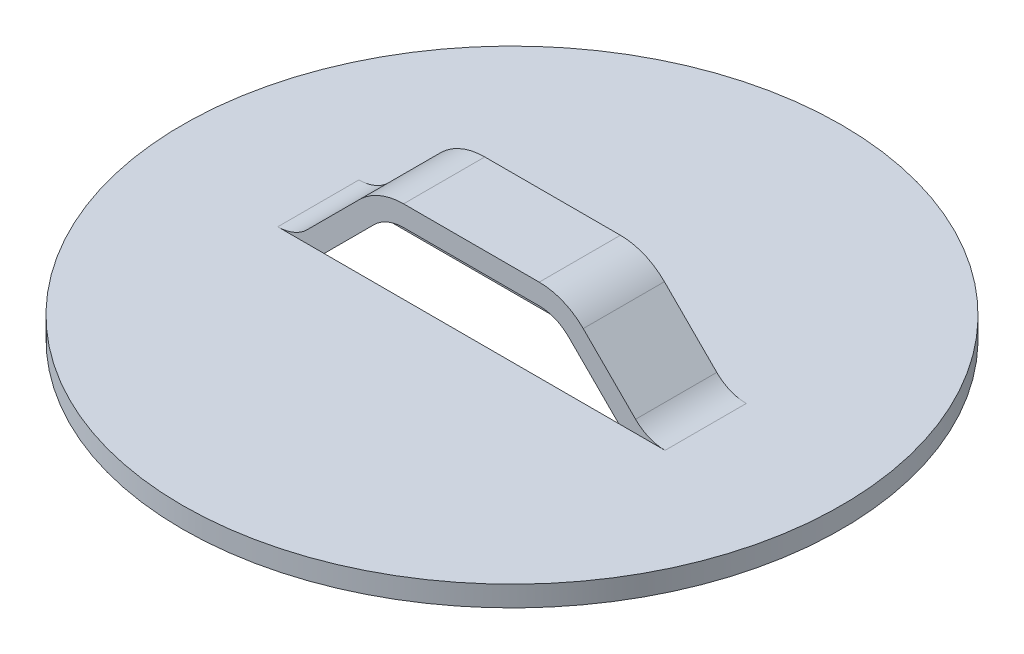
ISO-10303-21;
HEADER;
FILE_DESCRIPTION(('STEP AP214'),'2;1');
FILE_NAME('part.step','',(''),(''),'','','');
FILE_SCHEMA(('AUTOMOTIVE_DESIGN { 1 0 10303 214 1 1 1 1 }'));
ENDSEC;
DATA;
#1=APPLICATION_CONTEXT('core data for automotive mechanical design processes');
#2=APPLICATION_PROTOCOL_DEFINITION('international standard','automotive_design',2000,#1);
#3=PRODUCT_CONTEXT('',#1,'mechanical');
#4=PRODUCT('Part','Part','',(#3));
#5=PRODUCT_RELATED_PRODUCT_CATEGORY('part','',(#4));
#6=PRODUCT_DEFINITION_FORMATION('','',#4);
#7=PRODUCT_DEFINITION_CONTEXT('part definition',#1,'design');
#8=PRODUCT_DEFINITION('design','',#6,#7);
#9=PRODUCT_DEFINITION_SHAPE('','',#8);
#10=(LENGTH_UNIT() NAMED_UNIT(*) SI_UNIT(.MILLI.,.METRE.));
#11=(NAMED_UNIT(*) PLANE_ANGLE_UNIT() SI_UNIT($,.RADIAN.));
#12=(NAMED_UNIT(*) SI_UNIT($,.STERADIAN.) SOLID_ANGLE_UNIT());
#13=UNCERTAINTY_MEASURE_WITH_UNIT(LENGTH_MEASURE(1.E-05),#10,'distance_accuracy_value','');
#14=(GEOMETRIC_REPRESENTATION_CONTEXT(3) GLOBAL_UNCERTAINTY_ASSIGNED_CONTEXT((#13)) GLOBAL_UNIT_ASSIGNED_CONTEXT((#10,
#11,#12)) REPRESENTATION_CONTEXT('',''));
#15=CARTESIAN_POINT('',(0.,0.,0.));
#16=DIRECTION('',(0.,0.,1.));
#17=DIRECTION('',(1.,0.,0.));
#18=AXIS2_PLACEMENT_3D('',#15,#16,#17);
#19=CARTESIAN_POINT('',(-9.32746093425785,2.0066,0.));
#20=DIRECTION('',(0.,0.,-1.));
#21=DIRECTION('',(-1.,0.,0.));
#22=AXIS2_PLACEMENT_3D('',#19,#20,#21);
#23=PLANE('',#22);
#24=DIRECTION('',(-1.,0.,0.));
#25=VECTOR('',#24,1.);
#26=CARTESIAN_POINT('',(-9.32746093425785,0.,0.));
#27=LINE('',#26,#25);
#28=CARTESIAN_POINT('',(9.32746093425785,0.,0.));
#29=VERTEX_POINT('',#28);
#30=CARTESIAN_POINT('',(7.09538004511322,0.,0.));
#31=VERTEX_POINT('',#30);
#32=EDGE_CURVE('E53',#29,#31,#27,.T.);
#33=ORIENTED_EDGE('',*,*,#32,.F.);
#34=CARTESIAN_POINT('',(9.32746093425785,2.0066,0.));
#35=DIRECTION('',(0.,0.,1.));
#36=DIRECTION('',(1.,0.,0.));
#37=AXIS2_PLACEMENT_3D('',#34,#35,#36);
#38=CIRCLE('',#37,2.0066);
#39=CARTESIAN_POINT('',(7.90858046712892,0.587719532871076,0.));
#40=VERTEX_POINT('',#39);
#41=EDGE_CURVE('E165',#29,#40,#38,.F.);
#42=ORIENTED_EDGE('',*,*,#41,.T.);
#43=DIRECTION('',(-0.707106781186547,0.707106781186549,0.));
#44=VECTOR('',#43,1.);
#45=CARTESIAN_POINT('',(5.3863595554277,3.10994044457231,0.));
#46=LINE('',#45,#44);
#47=CARTESIAN_POINT('',(5.3863595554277,3.10994044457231,0.));
#48=VERTEX_POINT('',#47);
#49=EDGE_CURVE('E196',#48,#40,#46,.F.);
#50=ORIENTED_EDGE('',*,*,#49,.F.);
#51=CARTESIAN_POINT('',(3.26701911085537,0.990599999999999,0.));
#52=DIRECTION('',(0.,0.,1.));
#53=DIRECTION('',(1.,0.,0.));
#54=AXIS2_PLACEMENT_3D('',#51,#52,#53);
#55=CIRCLE('',#54,2.9972);
#56=CARTESIAN_POINT('',(3.26701911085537,3.9878,0.));
#57=VERTEX_POINT('',#56);
#58=EDGE_CURVE('E200',#57,#48,#55,.F.);
#59=ORIENTED_EDGE('',*,*,#58,.F.);
#60=DIRECTION('',(1.,0.,0.));
#61=VECTOR('',#60,1.);
#62=CARTESIAN_POINT('',(-3.26701911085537,3.9878,0.));
#63=LINE('',#62,#61);
#64=CARTESIAN_POINT('',(-3.26701911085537,3.9878,0.));
#65=VERTEX_POINT('',#64);
#66=EDGE_CURVE('E204',#65,#57,#63,.T.);
#67=ORIENTED_EDGE('',*,*,#66,.F.);
#68=CARTESIAN_POINT('',(-3.26701911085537,0.990599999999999,0.));
#69=DIRECTION('',(0.,0.,1.));
#70=DIRECTION('',(1.,0.,0.));
#71=AXIS2_PLACEMENT_3D('',#68,#69,#70);
#72=CIRCLE('',#71,2.9972);
#73=CARTESIAN_POINT('',(-5.3863595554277,3.10994044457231,0.));
#74=VERTEX_POINT('',#73);
#75=EDGE_CURVE('E208',#74,#65,#72,.F.);
#76=ORIENTED_EDGE('',*,*,#75,.F.);
#77=DIRECTION('',(-0.707106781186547,-0.707106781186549,0.));
#78=VECTOR('',#77,1.);
#79=CARTESIAN_POINT('',(-7.90858046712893,0.587719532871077,0.));
#80=LINE('',#79,#78);
#81=CARTESIAN_POINT('',(-7.90858046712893,0.587719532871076,0.));
#82=VERTEX_POINT('',#81);
#83=EDGE_CURVE('E212',#82,#74,#80,.F.);
#84=ORIENTED_EDGE('',*,*,#83,.F.);
#85=CARTESIAN_POINT('',(-9.32746093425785,2.0066,0.));
#86=DIRECTION('',(0.,0.,1.));
#87=DIRECTION('',(1.,0.,0.));
#88=AXIS2_PLACEMENT_3D('',#85,#86,#87);
#89=CIRCLE('',#88,2.0066);
#90=CARTESIAN_POINT('',(-9.32746093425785,0.,0.));
#91=VERTEX_POINT('',#90);
#92=EDGE_CURVE('E216',#82,#91,#89,.F.);
#93=ORIENTED_EDGE('',*,*,#92,.T.);
#94=CARTESIAN_POINT('',(-7.09538004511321,0.,0.));
#95=VERTEX_POINT('',#94);
#96=EDGE_CURVE('E173',#95,#91,#27,.T.);
#97=ORIENTED_EDGE('',*,*,#96,.F.);
#98=DIRECTION('',(0.707106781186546,0.707106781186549,0.));
#99=VECTOR('',#98,1.);
#100=CARTESIAN_POINT('',(-7.20812048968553,-0.112740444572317,0.));
#101=LINE('',#100,#99);
#102=CARTESIAN_POINT('',(-4.6858995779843,2.40948046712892,0.));
#103=VERTEX_POINT('',#102);
#104=EDGE_CURVE('E218',#103,#95,#101,.F.);
#105=ORIENTED_EDGE('',*,*,#104,.F.);
#106=CARTESIAN_POINT('',(-3.26701911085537,0.990599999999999,0.));
#107=DIRECTION('',(0.,0.,1.));
#108=DIRECTION('',(1.,0.,0.));
#109=AXIS2_PLACEMENT_3D('',#106,#107,#108);
#110=CIRCLE('',#109,2.0066);
#111=CARTESIAN_POINT('',(-3.26701911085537,2.9972,0.));
#112=VERTEX_POINT('',#111);
#113=EDGE_CURVE('E222',#103,#112,#110,.F.);
#114=ORIENTED_EDGE('',*,*,#113,.T.);
#115=DIRECTION('',(1.,0.,0.));
#116=VECTOR('',#115,1.);
#117=CARTESIAN_POINT('',(-3.26701911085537,2.9972,0.));
#118=LINE('',#117,#116);
#119=CARTESIAN_POINT('',(3.26701911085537,2.9972,0.));
#120=VERTEX_POINT('',#119);
#121=EDGE_CURVE('E223',#120,#112,#118,.F.);
#122=ORIENTED_EDGE('',*,*,#121,.F.);
#123=CARTESIAN_POINT('',(3.26701911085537,0.990599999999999,0.));
#124=DIRECTION('',(0.,0.,1.));
#125=DIRECTION('',(1.,0.,0.));
#126=AXIS2_PLACEMENT_3D('',#123,#124,#125);
#127=CIRCLE('',#126,2.0066);
#128=CARTESIAN_POINT('',(4.6858995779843,2.40948046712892,0.));
#129=VERTEX_POINT('',#128);
#130=EDGE_CURVE('E226',#120,#129,#127,.F.);
#131=ORIENTED_EDGE('',*,*,#130,.T.);
#132=DIRECTION('',(0.707106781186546,-0.707106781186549,0.));
#133=VECTOR('',#132,1.);
#134=CARTESIAN_POINT('',(4.6858995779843,2.40948046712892,0.));
#135=LINE('',#134,#133);
#136=EDGE_CURVE('E168',#31,#129,#135,.F.);
#137=ORIENTED_EDGE('',*,*,#136,.F.);
#138=EDGE_LOOP('',(#33,#42,#50,#59,#67,#76,#84,#93,#97,#105,#114,#122,#131,#137));
#139=FACE_BOUND('',#138,.T.);
#140=ADVANCED_FACE('F39',(#139),#23,.F.);
#141=CARTESIAN_POINT('',(-9.32746093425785,2.0066,-3.9116));
#142=DIRECTION('',(0.,0.,-1.));
#143=DIRECTION('',(-1.,0.,0.));
#144=AXIS2_PLACEMENT_3D('',#141,#142,#143);
#145=PLANE('',#144);
#146=CARTESIAN_POINT('',(9.32746093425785,2.0066,-3.9116));
#147=DIRECTION('',(0.,0.,1.));
#148=DIRECTION('',(1.,0.,0.));
#149=AXIS2_PLACEMENT_3D('',#146,#147,#148);
#150=CIRCLE('',#149,2.0066);
#151=CARTESIAN_POINT('',(7.90858046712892,0.587719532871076,-3.9116));
#152=VERTEX_POINT('',#151);
#153=CARTESIAN_POINT('',(9.32746093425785,0.,-3.9116));
#154=VERTEX_POINT('',#153);
#155=EDGE_CURVE('E250',#152,#154,#150,.T.);
#156=ORIENTED_EDGE('',*,*,#155,.T.);
#157=DIRECTION('',(-1.,0.,0.));
#158=VECTOR('',#157,1.);
#159=CARTESIAN_POINT('',(-9.32746093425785,0.,-3.9116));
#160=LINE('',#159,#158);
#161=CARTESIAN_POINT('',(7.09538004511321,0.,-3.9116));
#162=VERTEX_POINT('',#161);
#163=EDGE_CURVE('E11',#154,#162,#160,.T.);
#164=ORIENTED_EDGE('',*,*,#163,.T.);
#165=DIRECTION('',(-0.707106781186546,0.707106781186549,0.));
#166=VECTOR('',#165,1.);
#167=CARTESIAN_POINT('',(7.20812048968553,-0.112740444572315,-3.9116));
#168=LINE('',#167,#166);
#169=CARTESIAN_POINT('',(4.6858995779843,2.40948046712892,-3.9116));
#170=VERTEX_POINT('',#169);
#171=EDGE_CURVE('E249',#162,#170,#168,.T.);
#172=ORIENTED_EDGE('',*,*,#171,.T.);
#173=CARTESIAN_POINT('',(3.26701911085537,0.990599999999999,-3.9116));
#174=DIRECTION('',(0.,0.,1.));
#175=DIRECTION('',(1.,0.,0.));
#176=AXIS2_PLACEMENT_3D('',#173,#174,#175);
#177=CIRCLE('',#176,2.0066);
#178=CARTESIAN_POINT('',(3.26701911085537,2.9972,-3.9116));
#179=VERTEX_POINT('',#178);
#180=EDGE_CURVE('E242',#170,#179,#177,.T.);
#181=ORIENTED_EDGE('',*,*,#180,.T.);
#182=DIRECTION('',(-1.,0.,0.));
#183=VECTOR('',#182,1.);
#184=CARTESIAN_POINT('',(-9.32746093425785,2.9972,-3.9116));
#185=LINE('',#184,#183);
#186=CARTESIAN_POINT('',(-3.26701911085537,2.9972,-3.9116));
#187=VERTEX_POINT('',#186);
#188=EDGE_CURVE('E241',#179,#187,#185,.T.);
#189=ORIENTED_EDGE('',*,*,#188,.T.);
#190=CARTESIAN_POINT('',(-3.26701911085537,0.990599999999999,-3.9116));
#191=DIRECTION('',(0.,0.,1.));
#192=DIRECTION('',(1.,0.,0.));
#193=AXIS2_PLACEMENT_3D('',#190,#191,#192);
#194=CIRCLE('',#193,2.0066);
#195=CARTESIAN_POINT('',(-4.6858995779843,2.40948046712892,-3.9116));
#196=VERTEX_POINT('',#195);
#197=EDGE_CURVE('E238',#187,#196,#194,.T.);
#198=ORIENTED_EDGE('',*,*,#197,.T.);
#199=DIRECTION('',(-0.707106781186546,-0.707106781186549,0.));
#200=VECTOR('',#199,1.);
#201=CARTESIAN_POINT('',(-4.6858995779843,2.40948046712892,-3.9116));
#202=LINE('',#201,#200);
#203=CARTESIAN_POINT('',(-7.09538004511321,0.,-3.9116));
#204=VERTEX_POINT('',#203);
#205=EDGE_CURVE('E237',#196,#204,#202,.T.);
#206=ORIENTED_EDGE('',*,*,#205,.T.);
#207=DIRECTION('',(1.,0.,0.));
#208=VECTOR('',#207,1.);
#209=CARTESIAN_POINT('',(-9.32746093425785,0.,-3.9116));
#210=LINE('',#209,#208);
#211=CARTESIAN_POINT('',(-9.32746093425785,0.,-3.9116));
#212=VERTEX_POINT('',#211);
#213=EDGE_CURVE('E285',#212,#204,#210,.T.);
#214=ORIENTED_EDGE('',*,*,#213,.F.);
#215=CARTESIAN_POINT('',(-9.32746093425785,2.0066,-3.9116));
#216=DIRECTION('',(0.,0.,1.));
#217=DIRECTION('',(1.,0.,0.));
#218=AXIS2_PLACEMENT_3D('',#215,#216,#217);
#219=CIRCLE('',#218,2.0066);
#220=CARTESIAN_POINT('',(-7.90858046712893,0.587719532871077,-3.9116));
#221=VERTEX_POINT('',#220);
#222=EDGE_CURVE('E261',#212,#221,#219,.T.);
#223=ORIENTED_EDGE('',*,*,#222,.T.);
#224=DIRECTION('',(0.707106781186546,0.707106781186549,0.));
#225=VECTOR('',#224,1.);
#226=CARTESIAN_POINT('',(-7.90858046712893,0.587719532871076,-3.9116));
#227=LINE('',#226,#225);
#228=CARTESIAN_POINT('',(-5.3863595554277,3.10994044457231,-3.9116));
#229=VERTEX_POINT('',#228);
#230=EDGE_CURVE('E260',#221,#229,#227,.T.);
#231=ORIENTED_EDGE('',*,*,#230,.T.);
#232=CARTESIAN_POINT('',(-3.26701911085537,0.990599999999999,-3.9116));
#233=DIRECTION('',(0.,0.,1.));
#234=DIRECTION('',(1.,0.,0.));
#235=AXIS2_PLACEMENT_3D('',#232,#233,#234);
#236=CIRCLE('',#235,2.9972);
#237=CARTESIAN_POINT('',(-3.26701911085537,3.9878,-3.9116));
#238=VERTEX_POINT('',#237);
#239=EDGE_CURVE('E257',#229,#238,#236,.F.);
#240=ORIENTED_EDGE('',*,*,#239,.T.);
#241=DIRECTION('',(-1.,0.,0.));
#242=VECTOR('',#241,1.);
#243=CARTESIAN_POINT('',(-9.32746093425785,3.9878,-3.9116));
#244=LINE('',#243,#242);
#245=CARTESIAN_POINT('',(3.26701911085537,3.9878,-3.9116));
#246=VERTEX_POINT('',#245);
#247=EDGE_CURVE('E256',#238,#246,#244,.F.);
#248=ORIENTED_EDGE('',*,*,#247,.T.);
#249=CARTESIAN_POINT('',(3.26701911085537,0.990599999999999,-3.9116));
#250=DIRECTION('',(0.,0.,1.));
#251=DIRECTION('',(1.,0.,0.));
#252=AXIS2_PLACEMENT_3D('',#249,#250,#251);
#253=CIRCLE('',#252,2.9972);
#254=CARTESIAN_POINT('',(5.3863595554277,3.10994044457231,-3.9116));
#255=VERTEX_POINT('',#254);
#256=EDGE_CURVE('E253',#246,#255,#253,.F.);
#257=ORIENTED_EDGE('',*,*,#256,.T.);
#258=DIRECTION('',(0.707106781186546,-0.707106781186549,0.));
#259=VECTOR('',#258,1.);
#260=CARTESIAN_POINT('',(5.3863595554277,3.10994044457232,-3.9116));
#261=LINE('',#260,#259);
#262=EDGE_CURVE('E252',#255,#152,#261,.T.);
#263=ORIENTED_EDGE('',*,*,#262,.T.);
#264=EDGE_LOOP('',(#156,#164,#172,#181,#189,#198,#206,#214,#223,#231,#240,#248,#257,#263));
#265=FACE_BOUND('',#264,.T.);
#266=ADVANCED_FACE('F355',(#265),#145,.T.);
#267=CARTESIAN_POINT('',(-9.32746093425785,2.0066,-3.9116));
#268=DIRECTION('',(0.,0.,1.));
#269=DIRECTION('',(1.,0.,0.));
#270=AXIS2_PLACEMENT_3D('',#267,#268,#269);
#271=CYLINDRICAL_SURFACE('',#270,2.0066);
#272=DIRECTION('',(0.,0.,1.));
#273=VECTOR('',#272,1.);
#274=CARTESIAN_POINT('',(-7.90858046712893,0.587719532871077,-3.9116));
#275=LINE('',#274,#273);
#276=EDGE_CURVE('E209',#221,#82,#275,.T.);
#277=ORIENTED_EDGE('',*,*,#276,.F.);
#278=ORIENTED_EDGE('',*,*,#222,.F.);
#279=DIRECTION('',(0.,0.,1.));
#280=VECTOR('',#279,1.);
#281=CARTESIAN_POINT('',(-9.32746093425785,0.,-3.9116));
#282=LINE('',#281,#280);
#283=EDGE_CURVE('E213',#91,#212,#282,.F.);
#284=ORIENTED_EDGE('',*,*,#283,.F.);
#285=ORIENTED_EDGE('',*,*,#92,.F.);
#286=EDGE_LOOP('',(#277,#278,#284,#285));
#287=FACE_BOUND('',#286,.T.);
#288=ADVANCED_FACE('F283',(#287),#271,.F.);
#289=CARTESIAN_POINT('',(-7.90858046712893,0.587719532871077,-3.9116));
#290=DIRECTION('',(-0.707106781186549,0.707106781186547,0.));
#291=DIRECTION('',(-0.707106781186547,-0.707106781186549,0.));
#292=AXIS2_PLACEMENT_3D('',#289,#290,#291);
#293=PLANE('',#292);
#294=ORIENTED_EDGE('',*,*,#230,.F.);
#295=ORIENTED_EDGE('',*,*,#276,.T.);
#296=ORIENTED_EDGE('',*,*,#83,.T.);
#297=DIRECTION('',(0.,0.,1.));
#298=VECTOR('',#297,1.);
#299=CARTESIAN_POINT('',(-5.3863595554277,3.10994044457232,-3.9116));
#300=LINE('',#299,#298);
#301=EDGE_CURVE('E205',#229,#74,#300,.T.);
#302=ORIENTED_EDGE('',*,*,#301,.F.);
#303=EDGE_LOOP('',(#294,#295,#296,#302));
#304=FACE_BOUND('',#303,.T.);
#305=ADVANCED_FACE('F364',(#304),#293,.T.);
#306=CARTESIAN_POINT('',(-3.26701911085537,0.990599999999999,-3.9116));
#307=DIRECTION('',(0.,0.,1.));
#308=DIRECTION('',(1.,0.,0.));
#309=AXIS2_PLACEMENT_3D('',#306,#307,#308);
#310=CYLINDRICAL_SURFACE('',#309,2.9972);
#311=ORIENTED_EDGE('',*,*,#239,.F.);
#312=ORIENTED_EDGE('',*,*,#301,.T.);
#313=ORIENTED_EDGE('',*,*,#75,.T.);
#314=DIRECTION('',(0.,0.,1.));
#315=VECTOR('',#314,1.);
#316=CARTESIAN_POINT('',(-3.26701911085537,3.9878,-3.9116));
#317=LINE('',#316,#315);
#318=EDGE_CURVE('E201',#238,#65,#317,.T.);
#319=ORIENTED_EDGE('',*,*,#318,.F.);
#320=EDGE_LOOP('',(#311,#312,#313,#319));
#321=FACE_BOUND('',#320,.T.);
#322=ADVANCED_FACE('F407',(#321),#310,.T.);
#323=CARTESIAN_POINT('',(-3.26701911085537,3.9878,-3.9116));
#324=DIRECTION('',(0.,1.,0.));
#325=DIRECTION('',(0.,0.,1.));
#326=AXIS2_PLACEMENT_3D('',#323,#324,#325);
#327=PLANE('',#326);
#328=ORIENTED_EDGE('',*,*,#247,.F.);
#329=ORIENTED_EDGE('',*,*,#318,.T.);
#330=ORIENTED_EDGE('',*,*,#66,.T.);
#331=DIRECTION('',(0.,0.,1.));
#332=VECTOR('',#331,1.);
#333=CARTESIAN_POINT('',(3.26701911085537,3.9878,-3.9116));
#334=LINE('',#333,#332);
#335=EDGE_CURVE('E197',#246,#57,#334,.T.);
#336=ORIENTED_EDGE('',*,*,#335,.F.);
#337=EDGE_LOOP('',(#328,#329,#330,#336));
#338=FACE_BOUND('',#337,.T.);
#339=ADVANCED_FACE('F403',(#338),#327,.T.);
#340=CARTESIAN_POINT('',(3.26701911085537,0.990599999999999,-3.9116));
#341=DIRECTION('',(0.,0.,1.));
#342=DIRECTION('',(1.,0.,0.));
#343=AXIS2_PLACEMENT_3D('',#340,#341,#342);
#344=CYLINDRICAL_SURFACE('',#343,2.9972);
#345=ORIENTED_EDGE('',*,*,#256,.F.);
#346=ORIENTED_EDGE('',*,*,#335,.T.);
#347=ORIENTED_EDGE('',*,*,#58,.T.);
#348=DIRECTION('',(0.,0.,1.));
#349=VECTOR('',#348,1.);
#350=CARTESIAN_POINT('',(5.3863595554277,3.10994044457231,-3.9116));
#351=LINE('',#350,#349);
#352=EDGE_CURVE('E193',#255,#48,#351,.T.);
#353=ORIENTED_EDGE('',*,*,#352,.F.);
#354=EDGE_LOOP('',(#345,#346,#347,#353));
#355=FACE_BOUND('',#354,.T.);
#356=ADVANCED_FACE('F399',(#355),#344,.T.);
#357=CARTESIAN_POINT('',(5.3863595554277,3.10994044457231,-3.9116));
#358=DIRECTION('',(0.707106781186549,0.707106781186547,0.));
#359=DIRECTION('',(-0.707106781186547,0.707106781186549,0.));
#360=AXIS2_PLACEMENT_3D('',#357,#358,#359);
#361=PLANE('',#360);
#362=ORIENTED_EDGE('',*,*,#262,.F.);
#363=ORIENTED_EDGE('',*,*,#352,.T.);
#364=ORIENTED_EDGE('',*,*,#49,.T.);
#365=DIRECTION('',(0.,0.,1.));
#366=VECTOR('',#365,1.);
#367=CARTESIAN_POINT('',(7.90858046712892,0.587719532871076,-3.9116));
#368=LINE('',#367,#366);
#369=EDGE_CURVE('E179',#40,#152,#368,.F.);
#370=ORIENTED_EDGE('',*,*,#369,.T.);
#371=EDGE_LOOP('',(#362,#363,#364,#370));
#372=FACE_BOUND('',#371,.T.);
#373=ADVANCED_FACE('F396',(#372),#361,.T.);
#374=CARTESIAN_POINT('',(9.32746093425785,2.0066,-3.9116));
#375=DIRECTION('',(0.,0.,1.));
#376=DIRECTION('',(1.,0.,0.));
#377=AXIS2_PLACEMENT_3D('',#374,#375,#376);
#378=CYLINDRICAL_SURFACE('',#377,2.0066);
#379=DIRECTION('',(0.,0.,1.));
#380=VECTOR('',#379,1.);
#381=CARTESIAN_POINT('',(9.32746093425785,0.,-3.9116));
#382=LINE('',#381,#380);
#383=EDGE_CURVE('E177',#154,#29,#382,.T.);
#384=ORIENTED_EDGE('',*,*,#383,.F.);
#385=ORIENTED_EDGE('',*,*,#155,.F.);
#386=ORIENTED_EDGE('',*,*,#369,.F.);
#387=ORIENTED_EDGE('',*,*,#41,.F.);
#388=EDGE_LOOP('',(#384,#385,#386,#387));
#389=FACE_BOUND('',#388,.T.);
#390=ADVANCED_FACE('F175',(#389),#378,.F.);
#391=CARTESIAN_POINT('',(9.32746093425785,0.,-3.9116));
#392=DIRECTION('',(0.,1.,0.));
#393=DIRECTION('',(0.,0.,1.));
#394=AXIS2_PLACEMENT_3D('',#391,#392,#393);
#395=PLANE('',#394);
#396=CARTESIAN_POINT('',(0.,0.,-1.9558));
#397=DIRECTION('',(0.,-1.,0.));
#398=DIRECTION('',(0.,0.,-1.));
#399=AXIS2_PLACEMENT_3D('',#396,#397,#398);
#400=CIRCLE('',#399,15.875);
#401=CARTESIAN_POINT('',(0.,0.,-17.8308));
#402=VERTEX_POINT('',#401);
#403=EDGE_CURVE('E294',#402,#402,#400,.T.);
#404=ORIENTED_EDGE('',*,*,#403,.F.);
#405=EDGE_LOOP('',(#404));
#406=FACE_BOUND('',#405,.T.);
#407=ORIENTED_EDGE('',*,*,#383,.T.);
#408=ORIENTED_EDGE('',*,*,#32,.T.);
#409=EDGE_CURVE('E171',#31,#95,#27,.T.);
#410=ORIENTED_EDGE('',*,*,#409,.T.);
#411=ORIENTED_EDGE('',*,*,#96,.T.);
#412=ORIENTED_EDGE('',*,*,#283,.T.);
#413=ORIENTED_EDGE('',*,*,#213,.T.);
#414=EDGE_CURVE('E170',#204,#162,#210,.T.);
#415=ORIENTED_EDGE('',*,*,#414,.T.);
#416=ORIENTED_EDGE('',*,*,#163,.F.);
#417=EDGE_LOOP('',(#407,#408,#410,#411,#412,#413,#415,#416));
#418=FACE_BOUND('',#417,.T.);
#419=ADVANCED_FACE('F182',(#406,#418),#395,.T.);
#420=CARTESIAN_POINT('',(9.32746093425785,2.0066,-3.9116));
#421=DIRECTION('',(0.,0.,1.));
#422=DIRECTION('',(1.,0.,0.));
#423=AXIS2_PLACEMENT_3D('',#420,#421,#422);
#424=CYLINDRICAL_SURFACE('',#423,2.9972);
#425=CARTESIAN_POINT('',(9.32746093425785,2.0066,-3.9116));
#426=DIRECTION('',(0.,0.,1.));
#427=DIRECTION('',(1.,0.,0.));
#428=AXIS2_PLACEMENT_3D('',#425,#426,#427);
#429=CIRCLE('',#428,2.9972);
#430=CARTESIAN_POINT('',(9.32746093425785,-0.9906,-3.9116));
#431=VERTEX_POINT('',#430);
#432=CARTESIAN_POINT('',(7.20812048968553,-0.112740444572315,-3.9116));
#433=VERTEX_POINT('',#432);
#434=EDGE_CURVE('E246',#431,#433,#429,.F.);
#435=ORIENTED_EDGE('',*,*,#434,.F.);
#436=DIRECTION('',(0.,0.,1.));
#437=VECTOR('',#436,1.);
#438=CARTESIAN_POINT('',(9.32746093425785,-0.990599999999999,-3.9116));
#439=LINE('',#438,#437);
#440=CARTESIAN_POINT('',(9.32746093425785,-0.9906,0.));
#441=VERTEX_POINT('',#440);
#442=EDGE_CURVE('E187',#431,#441,#439,.T.);
#443=ORIENTED_EDGE('',*,*,#442,.T.);
#444=CARTESIAN_POINT('',(9.32746093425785,2.0066,0.));
#445=DIRECTION('',(0.,0.,1.));
#446=DIRECTION('',(1.,0.,0.));
#447=AXIS2_PLACEMENT_3D('',#444,#445,#446);
#448=CIRCLE('',#447,2.9972);
#449=CARTESIAN_POINT('',(7.20812048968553,-0.112740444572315,0.));
#450=VERTEX_POINT('',#449);
#451=EDGE_CURVE('E184',#441,#450,#448,.F.);
#452=ORIENTED_EDGE('',*,*,#451,.T.);
#453=DIRECTION('',(0.,0.,1.));
#454=VECTOR('',#453,1.);
#455=CARTESIAN_POINT('',(7.20812048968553,-0.112740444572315,-3.9116));
#456=LINE('',#455,#454);
#457=EDGE_CURVE('E229',#433,#450,#456,.T.);
#458=ORIENTED_EDGE('',*,*,#457,.F.);
#459=EDGE_LOOP('',(#435,#443,#452,#458));
#460=FACE_BOUND('',#459,.T.);
#461=ADVANCED_FACE('F328',(#460),#424,.T.);
#462=CARTESIAN_POINT('',(4.6858995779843,2.40948046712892,-3.9116));
#463=DIRECTION('',(-0.707106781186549,-0.707106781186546,0.));
#464=DIRECTION('',(0.707106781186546,-0.707106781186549,0.));
#465=AXIS2_PLACEMENT_3D('',#462,#463,#464);
#466=PLANE('',#465);
#467=EDGE_CURVE('E245',#433,#162,#168,.T.);
#468=ORIENTED_EDGE('',*,*,#467,.F.);
#469=ORIENTED_EDGE('',*,*,#457,.T.);
#470=EDGE_CURVE('E227',#450,#31,#135,.F.);
#471=ORIENTED_EDGE('',*,*,#470,.T.);
#472=ORIENTED_EDGE('',*,*,#136,.T.);
#473=DIRECTION('',(0.,0.,1.));
#474=VECTOR('',#473,1.);
#475=CARTESIAN_POINT('',(4.6858995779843,2.40948046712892,-3.9116));
#476=LINE('',#475,#474);
#477=EDGE_CURVE('E272',#129,#170,#476,.F.);
#478=ORIENTED_EDGE('',*,*,#477,.T.);
#479=ORIENTED_EDGE('',*,*,#171,.F.);
#480=EDGE_LOOP('',(#468,#469,#471,#472,#478,#479));
#481=FACE_BOUND('',#480,.T.);
#482=ADVANCED_FACE('F325',(#481),#466,.T.);
#483=CARTESIAN_POINT('',(3.26701911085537,0.990599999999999,-3.9116));
#484=DIRECTION('',(0.,0.,1.));
#485=DIRECTION('',(1.,0.,0.));
#486=AXIS2_PLACEMENT_3D('',#483,#484,#485);
#487=CYLINDRICAL_SURFACE('',#486,2.0066);
#488=DIRECTION('',(0.,0.,1.));
#489=VECTOR('',#488,1.);
#490=CARTESIAN_POINT('',(3.26701911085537,2.9972,-3.9116));
#491=LINE('',#490,#489);
#492=EDGE_CURVE('E225',#179,#120,#491,.T.);
#493=ORIENTED_EDGE('',*,*,#492,.F.);
#494=ORIENTED_EDGE('',*,*,#180,.F.);
#495=ORIENTED_EDGE('',*,*,#477,.F.);
#496=ORIENTED_EDGE('',*,*,#130,.F.);
#497=EDGE_LOOP('',(#493,#494,#495,#496));
#498=FACE_BOUND('',#497,.T.);
#499=ADVANCED_FACE('F382',(#498),#487,.F.);
#500=CARTESIAN_POINT('',(-3.26701911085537,2.9972,-3.9116));
#501=DIRECTION('',(0.,-1.,0.));
#502=DIRECTION('',(1.,0.,0.));
#503=AXIS2_PLACEMENT_3D('',#500,#501,#502);
#504=PLANE('',#503);
#505=ORIENTED_EDGE('',*,*,#188,.F.);
#506=ORIENTED_EDGE('',*,*,#492,.T.);
#507=ORIENTED_EDGE('',*,*,#121,.T.);
#508=DIRECTION('',(0.,0.,1.));
#509=VECTOR('',#508,1.);
#510=CARTESIAN_POINT('',(-3.26701911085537,2.9972,-3.9116));
#511=LINE('',#510,#509);
#512=EDGE_CURVE('E271',#112,#187,#511,.F.);
#513=ORIENTED_EDGE('',*,*,#512,.T.);
#514=EDGE_LOOP('',(#505,#506,#507,#513));
#515=FACE_BOUND('',#514,.T.);
#516=ADVANCED_FACE('F378',(#515),#504,.T.);
#517=CARTESIAN_POINT('',(-3.26701911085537,0.990599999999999,-3.9116));
#518=DIRECTION('',(0.,0.,1.));
#519=DIRECTION('',(1.,0.,0.));
#520=AXIS2_PLACEMENT_3D('',#517,#518,#519);
#521=CYLINDRICAL_SURFACE('',#520,2.0066);
#522=DIRECTION('',(0.,0.,1.));
#523=VECTOR('',#522,1.);
#524=CARTESIAN_POINT('',(-4.6858995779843,2.40948046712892,-3.9116));
#525=LINE('',#524,#523);
#526=EDGE_CURVE('E221',#196,#103,#525,.T.);
#527=ORIENTED_EDGE('',*,*,#526,.F.);
#528=ORIENTED_EDGE('',*,*,#197,.F.);
#529=ORIENTED_EDGE('',*,*,#512,.F.);
#530=ORIENTED_EDGE('',*,*,#113,.F.);
#531=EDGE_LOOP('',(#527,#528,#529,#530));
#532=FACE_BOUND('',#531,.T.);
#533=ADVANCED_FACE('F375',(#532),#521,.F.);
#534=CARTESIAN_POINT('',(-7.20812048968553,-0.112740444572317,-3.9116));
#535=DIRECTION('',(0.707106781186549,-0.707106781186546,0.));
#536=DIRECTION('',(0.707106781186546,0.707106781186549,0.));
#537=AXIS2_PLACEMENT_3D('',#534,#535,#536);
#538=PLANE('',#537);
#539=ORIENTED_EDGE('',*,*,#205,.F.);
#540=ORIENTED_EDGE('',*,*,#526,.T.);
#541=ORIENTED_EDGE('',*,*,#104,.T.);
#542=DIRECTION('',(-0.707106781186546,-0.707106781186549,0.));
#543=VECTOR('',#542,1.);
#544=CARTESIAN_POINT('',(-7.20812048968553,-0.112740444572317,0.));
#545=LINE('',#544,#543);
#546=CARTESIAN_POINT('',(-7.20812048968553,-0.112740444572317,0.));
#547=VERTEX_POINT('',#546);
#548=EDGE_CURVE('E217',#95,#547,#545,.T.);
#549=ORIENTED_EDGE('',*,*,#548,.T.);
#550=DIRECTION('',(0.,0.,1.));
#551=VECTOR('',#550,1.);
#552=CARTESIAN_POINT('',(-7.20812048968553,-0.112740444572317,-3.9116));
#553=LINE('',#552,#551);
#554=CARTESIAN_POINT('',(-7.20812048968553,-0.112740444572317,-3.9116));
#555=VERTEX_POINT('',#554);
#556=EDGE_CURVE('E268',#555,#547,#553,.T.);
#557=ORIENTED_EDGE('',*,*,#556,.F.);
#558=EDGE_CURVE('E61',#204,#555,#202,.T.);
#559=ORIENTED_EDGE('',*,*,#558,.F.);
#560=EDGE_LOOP('',(#539,#540,#541,#549,#557,#559));
#561=FACE_BOUND('',#560,.T.);
#562=ADVANCED_FACE('F370',(#561),#538,.T.);
#563=CARTESIAN_POINT('',(-9.32746093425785,2.0066,-3.9116));
#564=DIRECTION('',(0.,0.,1.));
#565=DIRECTION('',(1.,0.,0.));
#566=AXIS2_PLACEMENT_3D('',#563,#564,#565);
#567=CYLINDRICAL_SURFACE('',#566,2.9972);
#568=CARTESIAN_POINT('',(-9.32746093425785,2.0066,-3.9116));
#569=DIRECTION('',(0.,0.,1.));
#570=DIRECTION('',(1.,0.,0.));
#571=AXIS2_PLACEMENT_3D('',#568,#569,#570);
#572=CIRCLE('',#571,2.9972);
#573=CARTESIAN_POINT('',(-9.32746093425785,-0.9906,-3.9116));
#574=VERTEX_POINT('',#573);
#575=EDGE_CURVE('E46',#555,#574,#572,.F.);
#576=ORIENTED_EDGE('',*,*,#575,.F.);
#577=ORIENTED_EDGE('',*,*,#556,.T.);
#578=CARTESIAN_POINT('',(-9.32746093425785,2.0066,0.));
#579=DIRECTION('',(0.,0.,1.));
#580=DIRECTION('',(1.,0.,0.));
#581=AXIS2_PLACEMENT_3D('',#578,#579,#580);
#582=CIRCLE('',#581,2.9972);
#583=CARTESIAN_POINT('',(-9.32746093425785,-0.9906,0.));
#584=VERTEX_POINT('',#583);
#585=EDGE_CURVE('E265',#547,#584,#582,.F.);
#586=ORIENTED_EDGE('',*,*,#585,.T.);
#587=DIRECTION('',(0.,0.,-1.));
#588=VECTOR('',#587,1.);
#589=CARTESIAN_POINT('',(-9.32746093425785,-0.9906,-3.9116));
#590=LINE('',#589,#588);
#591=EDGE_CURVE('E264',#574,#584,#590,.F.);
#592=ORIENTED_EDGE('',*,*,#591,.F.);
#593=EDGE_LOOP('',(#576,#577,#586,#592));
#594=FACE_BOUND('',#593,.T.);
#595=ADVANCED_FACE('F340',(#594),#567,.T.);
#596=CARTESIAN_POINT('',(-15.875,-0.9906,-3.9116));
#597=DIRECTION('',(0.,-1.,0.));
#598=DIRECTION('',(0.,0.,-1.));
#599=AXIS2_PLACEMENT_3D('',#596,#597,#598);
#600=PLANE('',#599);
#601=DIRECTION('',(-1.,0.,0.));
#602=VECTOR('',#601,1.);
#603=CARTESIAN_POINT('',(-9.32746093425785,-0.9906,0.));
#604=LINE('',#603,#602);
#605=EDGE_CURVE('E288',#441,#584,#604,.T.);
#606=ORIENTED_EDGE('',*,*,#605,.F.);
#607=ORIENTED_EDGE('',*,*,#442,.F.);
#608=DIRECTION('',(1.,0.,0.));
#609=VECTOR('',#608,1.);
#610=CARTESIAN_POINT('',(-9.32746093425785,-0.9906,-3.9116));
#611=LINE('',#610,#609);
#612=EDGE_CURVE('E286',#574,#431,#611,.T.);
#613=ORIENTED_EDGE('',*,*,#612,.F.);
#614=ORIENTED_EDGE('',*,*,#591,.T.);
#615=EDGE_LOOP('',(#606,#607,#613,#614));
#616=FACE_BOUND('',#615,.T.);
#617=CARTESIAN_POINT('',(0.,-0.9906,-1.9558));
#618=DIRECTION('',(0.,-1.,0.));
#619=DIRECTION('',(0.,0.,-1.));
#620=AXIS2_PLACEMENT_3D('',#617,#618,#619);
#621=CIRCLE('',#620,15.875);
#622=CARTESIAN_POINT('',(0.,-0.9906,-17.8308));
#623=VERTEX_POINT('',#622);
#624=EDGE_CURVE('E292',#623,#623,#621,.T.);
#625=ORIENTED_EDGE('',*,*,#624,.T.);
#626=EDGE_LOOP('',(#625));
#627=FACE_BOUND('',#626,.T.);
#628=ADVANCED_FACE('F335',(#616,#627),#600,.T.);
#629=CARTESIAN_POINT('',(0.,0.,-1.9558));
#630=DIRECTION('',(0.,-1.,0.));
#631=DIRECTION('',(0.,0.,-1.));
#632=AXIS2_PLACEMENT_3D('',#629,#630,#631);
#633=CYLINDRICAL_SURFACE('',#632,15.875);
#634=ORIENTED_EDGE('',*,*,#403,.T.);
#635=EDGE_LOOP('',(#634));
#636=FACE_BOUND('',#635,.T.);
#637=ORIENTED_EDGE('',*,*,#624,.F.);
#638=EDGE_LOOP('',(#637));
#639=FACE_BOUND('',#638,.T.);
#640=ADVANCED_FACE('F345',(#636,#639),#633,.T.);
#641=CARTESIAN_POINT('',(-9.32746093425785,0.,-3.9116));
#642=DIRECTION('',(0.,0.,-1.));
#643=DIRECTION('',(-1.,0.,0.));
#644=AXIS2_PLACEMENT_3D('',#641,#642,#643);
#645=PLANE('',#644);
#646=ORIENTED_EDGE('',*,*,#434,.T.);
#647=ORIENTED_EDGE('',*,*,#467,.T.);
#648=ORIENTED_EDGE('',*,*,#414,.F.);
#649=ORIENTED_EDGE('',*,*,#558,.T.);
#650=ORIENTED_EDGE('',*,*,#575,.T.);
#651=ORIENTED_EDGE('',*,*,#612,.T.);
#652=EDGE_LOOP('',(#646,#647,#648,#649,#650,#651));
#653=FACE_BOUND('',#652,.T.);
#654=ADVANCED_FACE('F342',(#653),#645,.F.);
#655=CARTESIAN_POINT('',(-9.32746093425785,0.,0.));
#656=DIRECTION('',(0.,0.,1.));
#657=DIRECTION('',(1.,0.,0.));
#658=AXIS2_PLACEMENT_3D('',#655,#656,#657);
#659=PLANE('',#658);
#660=ORIENTED_EDGE('',*,*,#451,.F.);
#661=ORIENTED_EDGE('',*,*,#605,.T.);
#662=ORIENTED_EDGE('',*,*,#585,.F.);
#663=ORIENTED_EDGE('',*,*,#548,.F.);
#664=ORIENTED_EDGE('',*,*,#409,.F.);
#665=ORIENTED_EDGE('',*,*,#470,.F.);
#666=EDGE_LOOP('',(#660,#661,#662,#663,#664,#665));
#667=FACE_BOUND('',#666,.T.);
#668=ADVANCED_FACE('F333',(#667),#659,.F.);
#669=CLOSED_SHELL('',(#140,#266,#288,#305,#322,#339,#356,#373,#390,#419,#461,#482,#499,#516,
#533,#562,#595,#628,#640,#654,#668));
#670=MANIFOLD_SOLID_BREP('B2',#669);
#671=ADVANCED_BREP_SHAPE_REPRESENTATION('',(#18,#670),#14);
#672=SHAPE_DEFINITION_REPRESENTATION(#9,#671);
ENDSEC;
END-ISO-10303-21;
